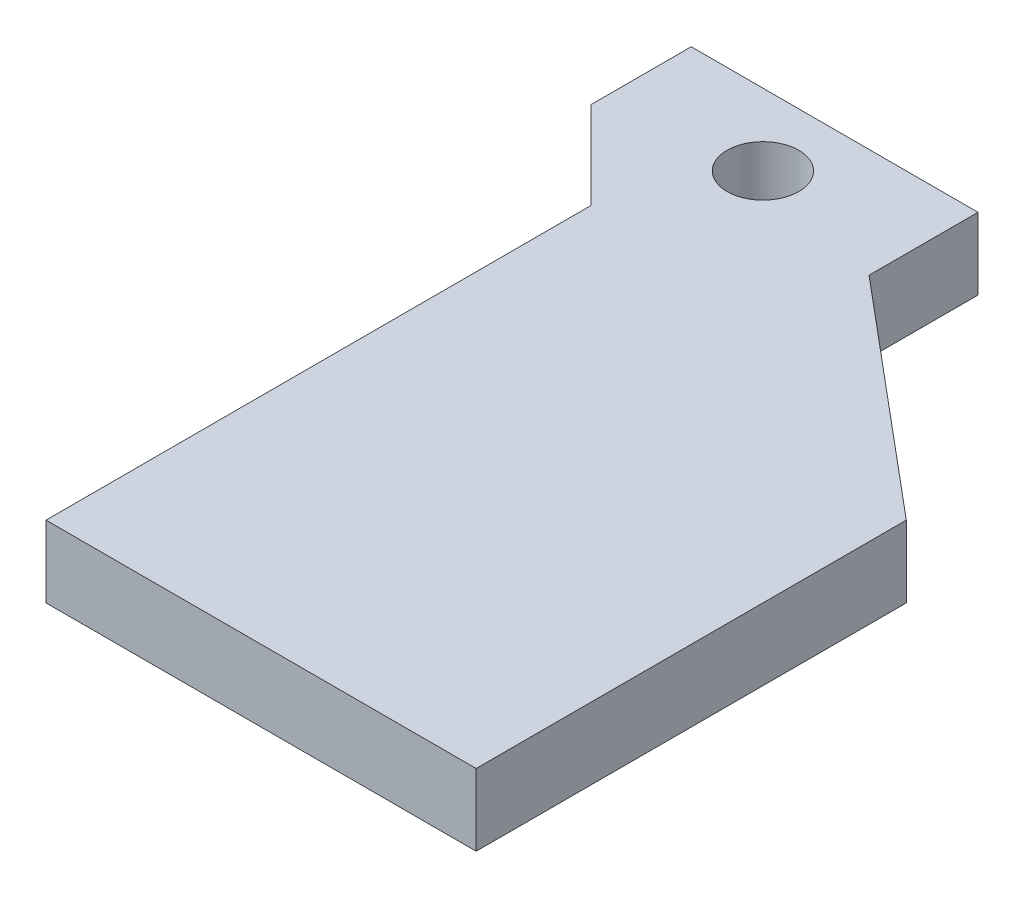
from build123d import *

# Parameters (mm, degrees)
EXTRUDE1_DEPTH     = 5
SKETCH2_R          = 2.5
CUT_EXTRUDE1_DEPTH = 52.736318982


with BuildPart() as part:
    # Sketch1 → Extrude1 (new body)
    with BuildSketch(Plane(origin=(0, 0, 0), x_dir=(1, 0, 0), z_dir=(0, 1, 0))):
        Polygon((-5.355214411, -5.878499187), (24.644785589, -5.878499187), (24.644785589, 24.121500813), (8.552557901, 37.613728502), (8.552557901, 45.213728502), (-11.447442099, 45.213728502), (-11.447442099, 38.213728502), (-5.355214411, 32.121500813), align=None)
    extrude(amount=EXTRUDE1_DEPTH)

    # Sketch2 → Cut-Extrude1 (cut, through all)
    with BuildSketch(Plane(origin=(0, 5, 0), x_dir=(-1, 0, 0), z_dir=(0, 1, 0))):
        with Locations(Location((1.447442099, -40.213728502, 0), (0, 0, 90))):
            Circle(SKETCH2_R)
    extrude(amount=-CUT_EXTRUDE1_DEPTH, mode=Mode.SUBTRACT)


solid = part.part
